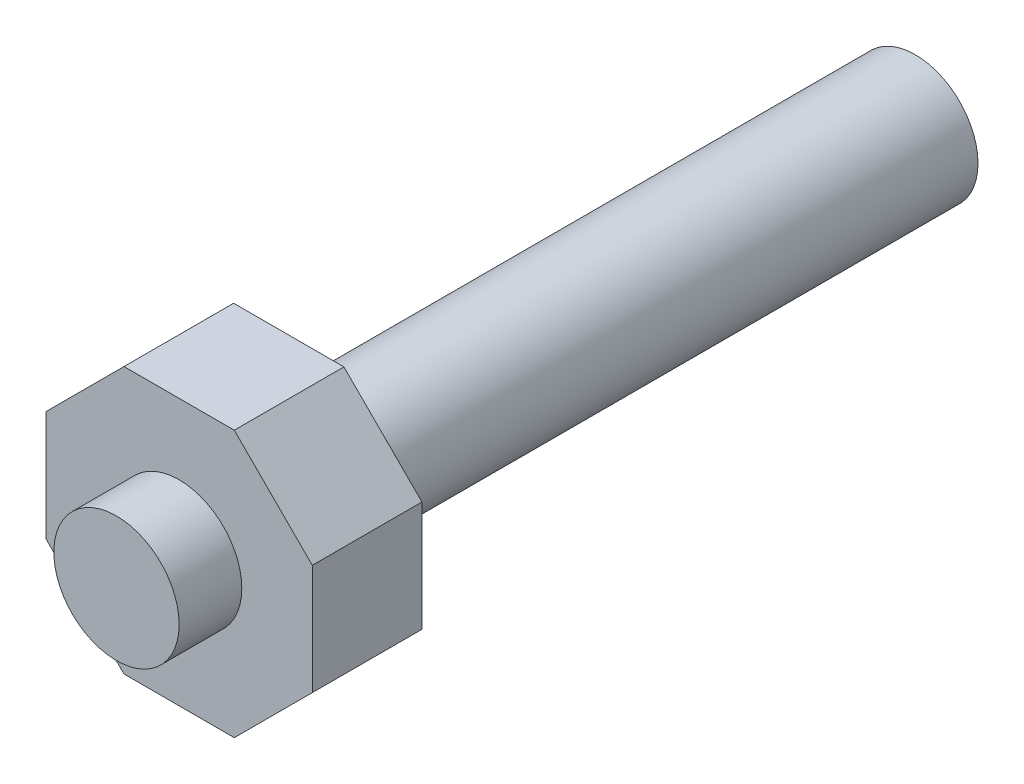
ISO-10303-21;
HEADER;
FILE_DESCRIPTION(('STEP AP214'),'2;1');
FILE_NAME('part.step','',(''),(''),'','','');
FILE_SCHEMA(('AUTOMOTIVE_DESIGN { 1 0 10303 214 1 1 1 1 }'));
ENDSEC;
DATA;
#1=APPLICATION_CONTEXT('core data for automotive mechanical design processes');
#2=APPLICATION_PROTOCOL_DEFINITION('international standard','automotive_design',2000,#1);
#3=PRODUCT_CONTEXT('',#1,'mechanical');
#4=PRODUCT('Part','Part','',(#3));
#5=PRODUCT_RELATED_PRODUCT_CATEGORY('part','',(#4));
#6=PRODUCT_DEFINITION_FORMATION('','',#4);
#7=PRODUCT_DEFINITION_CONTEXT('part definition',#1,'design');
#8=PRODUCT_DEFINITION('design','',#6,#7);
#9=PRODUCT_DEFINITION_SHAPE('','',#8);
#10=(LENGTH_UNIT() NAMED_UNIT(*) SI_UNIT(.MILLI.,.METRE.));
#11=(NAMED_UNIT(*) PLANE_ANGLE_UNIT() SI_UNIT($,.RADIAN.));
#12=(NAMED_UNIT(*) SI_UNIT($,.STERADIAN.) SOLID_ANGLE_UNIT());
#13=UNCERTAINTY_MEASURE_WITH_UNIT(LENGTH_MEASURE(1.E-05),#10,'distance_accuracy_value','');
#14=(GEOMETRIC_REPRESENTATION_CONTEXT(3) GLOBAL_UNCERTAINTY_ASSIGNED_CONTEXT((#13)) GLOBAL_UNIT_ASSIGNED_CONTEXT((#10,
#11,#12)) REPRESENTATION_CONTEXT('',''));
#15=CARTESIAN_POINT('',(0.,0.,0.));
#16=DIRECTION('',(0.,0.,1.));
#17=DIRECTION('',(1.,0.,0.));
#18=AXIS2_PLACEMENT_3D('',#15,#16,#17);
#19=CARTESIAN_POINT('',(4.,0.,40.));
#20=DIRECTION('',(0.,0.,1.));
#21=DIRECTION('',(1.,0.,0.));
#22=AXIS2_PLACEMENT_3D('',#19,#20,#21);
#23=PLANE('',#22);
#24=CARTESIAN_POINT('',(0.,0.,40.));
#25=DIRECTION('',(0.,0.,1.));
#26=DIRECTION('',(1.,0.,0.));
#27=AXIS2_PLACEMENT_3D('',#24,#25,#26);
#28=CIRCLE('',#27,4.);
#29=CARTESIAN_POINT('',(4.,0.,40.));
#30=VERTEX_POINT('',#29);
#31=EDGE_CURVE('E22',#30,#30,#28,.T.);
#32=ORIENTED_EDGE('',*,*,#31,.T.);
#33=EDGE_LOOP('',(#32));
#34=FACE_BOUND('',#33,.T.);
#35=DIRECTION('',(-0.707106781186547,-0.707106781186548,0.));
#36=VECTOR('',#35,1.);
#37=CARTESIAN_POINT('',(8.5,-3.52081528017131,40.));
#38=LINE('',#37,#36);
#39=CARTESIAN_POINT('',(8.5,-3.52081528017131,40.));
#40=VERTEX_POINT('',#39);
#41=CARTESIAN_POINT('',(3.52081528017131,-8.5,40.));
#42=VERTEX_POINT('',#41);
#43=EDGE_CURVE('E101',#40,#42,#38,.T.);
#44=ORIENTED_EDGE('',*,*,#43,.T.);
#45=DIRECTION('',(1.,0.,0.));
#46=VECTOR('',#45,1.);
#47=CARTESIAN_POINT('',(-3.5208152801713,-8.5,40.));
#48=LINE('',#47,#46);
#49=CARTESIAN_POINT('',(-3.5208152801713,-8.5,40.));
#50=VERTEX_POINT('',#49);
#51=EDGE_CURVE('E99',#50,#42,#48,.T.);
#52=ORIENTED_EDGE('',*,*,#51,.F.);
#53=DIRECTION('',(0.707106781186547,-0.707106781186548,0.));
#54=VECTOR('',#53,1.);
#55=CARTESIAN_POINT('',(-8.5,-3.5208152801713,40.));
#56=LINE('',#55,#54);
#57=CARTESIAN_POINT('',(-8.5,-3.5208152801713,40.));
#58=VERTEX_POINT('',#57);
#59=EDGE_CURVE('E29',#58,#50,#56,.T.);
#60=ORIENTED_EDGE('',*,*,#59,.F.);
#61=DIRECTION('',(0.,-1.,0.));
#62=VECTOR('',#61,1.);
#63=CARTESIAN_POINT('',(-8.5,3.52081528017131,40.));
#64=LINE('',#63,#62);
#65=CARTESIAN_POINT('',(-8.5,3.52081528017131,40.));
#66=VERTEX_POINT('',#65);
#67=EDGE_CURVE('E89',#66,#58,#64,.T.);
#68=ORIENTED_EDGE('',*,*,#67,.F.);
#69=DIRECTION('',(0.707106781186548,0.707106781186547,0.));
#70=VECTOR('',#69,1.);
#71=CARTESIAN_POINT('',(-8.5,3.52081528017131,40.));
#72=LINE('',#71,#70);
#73=CARTESIAN_POINT('',(-3.5208152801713,8.5,40.));
#74=VERTEX_POINT('',#73);
#75=EDGE_CURVE('E94',#66,#74,#72,.T.);
#76=ORIENTED_EDGE('',*,*,#75,.T.);
#77=DIRECTION('',(1.,0.,0.));
#78=VECTOR('',#77,1.);
#79=CARTESIAN_POINT('',(-3.5208152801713,8.5,40.));
#80=LINE('',#79,#78);
#81=CARTESIAN_POINT('',(3.5208152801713,8.5,40.));
#82=VERTEX_POINT('',#81);
#83=EDGE_CURVE('E216',#74,#82,#80,.T.);
#84=ORIENTED_EDGE('',*,*,#83,.T.);
#85=DIRECTION('',(0.707106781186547,-0.707106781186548,0.));
#86=VECTOR('',#85,1.);
#87=CARTESIAN_POINT('',(3.5208152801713,8.5,40.));
#88=LINE('',#87,#86);
#89=CARTESIAN_POINT('',(8.5,3.5208152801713,40.));
#90=VERTEX_POINT('',#89);
#91=EDGE_CURVE('E214',#82,#90,#88,.T.);
#92=ORIENTED_EDGE('',*,*,#91,.T.);
#93=DIRECTION('',(0.,-1.,0.));
#94=VECTOR('',#93,1.);
#95=CARTESIAN_POINT('',(8.5,3.5208152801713,40.));
#96=LINE('',#95,#94);
#97=EDGE_CURVE('E126',#90,#40,#96,.T.);
#98=ORIENTED_EDGE('',*,*,#97,.T.);
#99=EDGE_LOOP('',(#44,#52,#60,#68,#76,#84,#92,#98));
#100=FACE_BOUND('',#99,.T.);
#101=ADVANCED_FACE('F14',(#34,#100),#23,.F.);
#102=CARTESIAN_POINT('',(0.,0.,0.));
#103=DIRECTION('',(0.,0.,1.));
#104=DIRECTION('',(1.,0.,0.));
#105=AXIS2_PLACEMENT_3D('',#102,#103,#104);
#106=PLANE('',#105);
#107=CARTESIAN_POINT('',(0.,0.,0.));
#108=DIRECTION('',(0.,0.,1.));
#109=DIRECTION('',(1.,0.,0.));
#110=AXIS2_PLACEMENT_3D('',#107,#108,#109);
#111=CIRCLE('',#110,4.);
#112=CARTESIAN_POINT('',(4.,0.,0.));
#113=VERTEX_POINT('',#112);
#114=EDGE_CURVE('E9',#113,#113,#111,.T.);
#115=ORIENTED_EDGE('',*,*,#114,.F.);
#116=EDGE_LOOP('',(#115));
#117=FACE_BOUND('',#116,.T.);
#118=ADVANCED_FACE('F16',(#117),#106,.F.);
#119=CARTESIAN_POINT('',(0.,0.,80.));
#120=DIRECTION('',(0.,0.,1.));
#121=DIRECTION('',(1.,0.,0.));
#122=AXIS2_PLACEMENT_3D('',#119,#120,#121);
#123=CYLINDRICAL_SURFACE('',#122,4.);
#124=ORIENTED_EDGE('',*,*,#31,.F.);
#125=EDGE_LOOP('',(#124));
#126=FACE_BOUND('',#125,.T.);
#127=ORIENTED_EDGE('',*,*,#114,.T.);
#128=EDGE_LOOP('',(#127));
#129=FACE_BOUND('',#128,.T.);
#130=ADVANCED_FACE('F147',(#126,#129),#123,.T.);
#131=CARTESIAN_POINT('',(8.5,-3.52081528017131,47.));
#132=DIRECTION('',(0.707106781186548,-0.707106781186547,0.));
#133=DIRECTION('',(0.707106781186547,0.707106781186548,0.));
#134=AXIS2_PLACEMENT_3D('',#131,#132,#133);
#135=PLANE('',#134);
#136=DIRECTION('',(0.,0.,-1.));
#137=VECTOR('',#136,1.);
#138=CARTESIAN_POINT('',(8.5,-3.52081528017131,47.));
#139=LINE('',#138,#137);
#140=CARTESIAN_POINT('',(8.5,-3.52081528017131,47.));
#141=VERTEX_POINT('',#140);
#142=EDGE_CURVE('E136',#141,#40,#139,.T.);
#143=ORIENTED_EDGE('',*,*,#142,.F.);
#144=DIRECTION('',(-0.707106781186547,-0.707106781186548,0.));
#145=VECTOR('',#144,1.);
#146=CARTESIAN_POINT('',(8.5,-3.52081528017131,47.));
#147=LINE('',#146,#145);
#148=CARTESIAN_POINT('',(3.52081528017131,-8.5,47.));
#149=VERTEX_POINT('',#148);
#150=EDGE_CURVE('E37',#141,#149,#147,.T.);
#151=ORIENTED_EDGE('',*,*,#150,.T.);
#152=DIRECTION('',(0.,0.,-1.));
#153=VECTOR('',#152,1.);
#154=CARTESIAN_POINT('',(3.52081528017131,-8.5,47.));
#155=LINE('',#154,#153);
#156=EDGE_CURVE('E109',#149,#42,#155,.T.);
#157=ORIENTED_EDGE('',*,*,#156,.T.);
#158=ORIENTED_EDGE('',*,*,#43,.F.);
#159=EDGE_LOOP('',(#143,#151,#157,#158));
#160=FACE_BOUND('',#159,.T.);
#161=ADVANCED_FACE('F150',(#160),#135,.T.);
#162=CARTESIAN_POINT('',(8.5,3.5208152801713,47.));
#163=DIRECTION('',(1.,0.,0.));
#164=DIRECTION('',(0.,1.,0.));
#165=AXIS2_PLACEMENT_3D('',#162,#163,#164);
#166=PLANE('',#165);
#167=DIRECTION('',(0.,0.,-1.));
#168=VECTOR('',#167,1.);
#169=CARTESIAN_POINT('',(8.5,3.5208152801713,47.));
#170=LINE('',#169,#168);
#171=CARTESIAN_POINT('',(8.5,3.5208152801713,47.));
#172=VERTEX_POINT('',#171);
#173=EDGE_CURVE('E134',#172,#90,#170,.T.);
#174=ORIENTED_EDGE('',*,*,#173,.F.);
#175=DIRECTION('',(0.,-1.,0.));
#176=VECTOR('',#175,1.);
#177=CARTESIAN_POINT('',(8.5,3.5208152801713,47.));
#178=LINE('',#177,#176);
#179=EDGE_CURVE('E106',#172,#141,#178,.T.);
#180=ORIENTED_EDGE('',*,*,#179,.T.);
#181=ORIENTED_EDGE('',*,*,#142,.T.);
#182=ORIENTED_EDGE('',*,*,#97,.F.);
#183=EDGE_LOOP('',(#174,#180,#181,#182));
#184=FACE_BOUND('',#183,.T.);
#185=ADVANCED_FACE('F177',(#184),#166,.T.);
#186=CARTESIAN_POINT('',(3.5208152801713,8.5,47.));
#187=DIRECTION('',(0.707106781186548,0.707106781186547,0.));
#188=DIRECTION('',(-0.707106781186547,0.707106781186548,0.));
#189=AXIS2_PLACEMENT_3D('',#186,#187,#188);
#190=PLANE('',#189);
#191=DIRECTION('',(0.,0.,-1.));
#192=VECTOR('',#191,1.);
#193=CARTESIAN_POINT('',(3.5208152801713,8.5,47.));
#194=LINE('',#193,#192);
#195=CARTESIAN_POINT('',(3.5208152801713,8.5,47.));
#196=VERTEX_POINT('',#195);
#197=EDGE_CURVE('E132',#196,#82,#194,.T.);
#198=ORIENTED_EDGE('',*,*,#197,.F.);
#199=DIRECTION('',(0.707106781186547,-0.707106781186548,0.));
#200=VECTOR('',#199,1.);
#201=CARTESIAN_POINT('',(3.5208152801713,8.5,47.));
#202=LINE('',#201,#200);
#203=EDGE_CURVE('E110',#196,#172,#202,.T.);
#204=ORIENTED_EDGE('',*,*,#203,.T.);
#205=ORIENTED_EDGE('',*,*,#173,.T.);
#206=ORIENTED_EDGE('',*,*,#91,.F.);
#207=EDGE_LOOP('',(#198,#204,#205,#206));
#208=FACE_BOUND('',#207,.T.);
#209=ADVANCED_FACE('F180',(#208),#190,.T.);
#210=CARTESIAN_POINT('',(-3.5208152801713,8.5,47.));
#211=DIRECTION('',(0.,1.,0.));
#212=DIRECTION('',(0.,0.,1.));
#213=AXIS2_PLACEMENT_3D('',#210,#211,#212);
#214=PLANE('',#213);
#215=DIRECTION('',(0.,0.,-1.));
#216=VECTOR('',#215,1.);
#217=CARTESIAN_POINT('',(-3.5208152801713,8.5,47.));
#218=LINE('',#217,#216);
#219=CARTESIAN_POINT('',(-3.5208152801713,8.5,47.));
#220=VERTEX_POINT('',#219);
#221=EDGE_CURVE('E130',#220,#74,#218,.T.);
#222=ORIENTED_EDGE('',*,*,#221,.F.);
#223=DIRECTION('',(1.,0.,0.));
#224=VECTOR('',#223,1.);
#225=CARTESIAN_POINT('',(-3.5208152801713,8.5,47.));
#226=LINE('',#225,#224);
#227=EDGE_CURVE('E113',#220,#196,#226,.T.);
#228=ORIENTED_EDGE('',*,*,#227,.T.);
#229=ORIENTED_EDGE('',*,*,#197,.T.);
#230=ORIENTED_EDGE('',*,*,#83,.F.);
#231=EDGE_LOOP('',(#222,#228,#229,#230));
#232=FACE_BOUND('',#231,.T.);
#233=ADVANCED_FACE('F184',(#232),#214,.T.);
#234=CARTESIAN_POINT('',(-8.5,3.52081528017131,47.));
#235=DIRECTION('',(-0.707106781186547,0.707106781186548,0.));
#236=DIRECTION('',(-0.707106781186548,-0.707106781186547,0.));
#237=AXIS2_PLACEMENT_3D('',#234,#235,#236);
#238=PLANE('',#237);
#239=DIRECTION('',(0.,0.,-1.));
#240=VECTOR('',#239,1.);
#241=CARTESIAN_POINT('',(-8.5,3.52081528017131,47.));
#242=LINE('',#241,#240);
#243=CARTESIAN_POINT('',(-8.5,3.52081528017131,47.));
#244=VERTEX_POINT('',#243);
#245=EDGE_CURVE('E85',#244,#66,#242,.T.);
#246=ORIENTED_EDGE('',*,*,#245,.F.);
#247=DIRECTION('',(0.707106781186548,0.707106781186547,0.));
#248=VECTOR('',#247,1.);
#249=CARTESIAN_POINT('',(-8.5,3.52081528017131,47.));
#250=LINE('',#249,#248);
#251=EDGE_CURVE('E116',#244,#220,#250,.T.);
#252=ORIENTED_EDGE('',*,*,#251,.T.);
#253=ORIENTED_EDGE('',*,*,#221,.T.);
#254=ORIENTED_EDGE('',*,*,#75,.F.);
#255=EDGE_LOOP('',(#246,#252,#253,#254));
#256=FACE_BOUND('',#255,.T.);
#257=ADVANCED_FACE('F188',(#256),#238,.T.);
#258=CARTESIAN_POINT('',(-8.5,3.52081528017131,47.));
#259=DIRECTION('',(1.,0.,0.));
#260=DIRECTION('',(0.,1.,0.));
#261=AXIS2_PLACEMENT_3D('',#258,#259,#260);
#262=PLANE('',#261);
#263=DIRECTION('',(0.,0.,-1.));
#264=VECTOR('',#263,1.);
#265=CARTESIAN_POINT('',(-8.5,-3.5208152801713,47.));
#266=LINE('',#265,#264);
#267=CARTESIAN_POINT('',(-8.5,-3.5208152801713,47.));
#268=VERTEX_POINT('',#267);
#269=EDGE_CURVE('E77',#268,#58,#266,.T.);
#270=ORIENTED_EDGE('',*,*,#269,.F.);
#271=DIRECTION('',(0.,-1.,0.));
#272=VECTOR('',#271,1.);
#273=CARTESIAN_POINT('',(-8.5,3.52081528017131,47.));
#274=LINE('',#273,#272);
#275=EDGE_CURVE('E119',#244,#268,#274,.T.);
#276=ORIENTED_EDGE('',*,*,#275,.F.);
#277=ORIENTED_EDGE('',*,*,#245,.T.);
#278=ORIENTED_EDGE('',*,*,#67,.T.);
#279=EDGE_LOOP('',(#270,#276,#277,#278));
#280=FACE_BOUND('',#279,.T.);
#281=ADVANCED_FACE('F90',(#280),#262,.F.);
#282=CARTESIAN_POINT('',(-8.5,-3.5208152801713,47.));
#283=DIRECTION('',(0.707106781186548,0.707106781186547,0.));
#284=DIRECTION('',(-0.707106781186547,0.707106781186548,0.));
#285=AXIS2_PLACEMENT_3D('',#282,#283,#284);
#286=PLANE('',#285);
#287=DIRECTION('',(0.,0.,-1.));
#288=VECTOR('',#287,1.);
#289=CARTESIAN_POINT('',(-3.5208152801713,-8.5,47.));
#290=LINE('',#289,#288);
#291=CARTESIAN_POINT('',(-3.5208152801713,-8.5,47.));
#292=VERTEX_POINT('',#291);
#293=EDGE_CURVE('E86',#292,#50,#290,.T.);
#294=ORIENTED_EDGE('',*,*,#293,.F.);
#295=DIRECTION('',(0.707106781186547,-0.707106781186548,0.));
#296=VECTOR('',#295,1.);
#297=CARTESIAN_POINT('',(-8.5,-3.5208152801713,47.));
#298=LINE('',#297,#296);
#299=EDGE_CURVE('E81',#268,#292,#298,.T.);
#300=ORIENTED_EDGE('',*,*,#299,.F.);
#301=ORIENTED_EDGE('',*,*,#269,.T.);
#302=ORIENTED_EDGE('',*,*,#59,.T.);
#303=EDGE_LOOP('',(#294,#300,#301,#302));
#304=FACE_BOUND('',#303,.T.);
#305=ADVANCED_FACE('F79',(#304),#286,.F.);
#306=CARTESIAN_POINT('',(-3.5208152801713,-8.5,47.));
#307=DIRECTION('',(0.,1.,0.));
#308=DIRECTION('',(0.,0.,1.));
#309=AXIS2_PLACEMENT_3D('',#306,#307,#308);
#310=PLANE('',#309);
#311=DIRECTION('',(1.,0.,0.));
#312=VECTOR('',#311,1.);
#313=CARTESIAN_POINT('',(-3.5208152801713,-8.5,47.));
#314=LINE('',#313,#312);
#315=EDGE_CURVE('E122',#292,#149,#314,.T.);
#316=ORIENTED_EDGE('',*,*,#315,.F.);
#317=ORIENTED_EDGE('',*,*,#293,.T.);
#318=ORIENTED_EDGE('',*,*,#51,.T.);
#319=ORIENTED_EDGE('',*,*,#156,.F.);
#320=EDGE_LOOP('',(#316,#317,#318,#319));
#321=FACE_BOUND('',#320,.T.);
#322=ADVANCED_FACE('F175',(#321),#310,.F.);
#323=CARTESIAN_POINT('',(4.,0.,51.));
#324=DIRECTION('',(0.,0.,-1.));
#325=DIRECTION('',(-1.,0.,0.));
#326=AXIS2_PLACEMENT_3D('',#323,#324,#325);
#327=PLANE('',#326);
#328=CARTESIAN_POINT('',(0.,0.,51.));
#329=DIRECTION('',(0.,0.,1.));
#330=DIRECTION('',(1.,0.,0.));
#331=AXIS2_PLACEMENT_3D('',#328,#329,#330);
#332=CIRCLE('',#331,4.);
#333=CARTESIAN_POINT('',(4.,0.,51.));
#334=VERTEX_POINT('',#333);
#335=EDGE_CURVE('E138',#334,#334,#332,.T.);
#336=ORIENTED_EDGE('',*,*,#335,.T.);
#337=EDGE_LOOP('',(#336));
#338=FACE_BOUND('',#337,.T.);
#339=ADVANCED_FACE('F171',(#338),#327,.F.);
#340=CARTESIAN_POINT('',(0.,0.,80.));
#341=DIRECTION('',(0.,0.,1.));
#342=DIRECTION('',(1.,0.,0.));
#343=AXIS2_PLACEMENT_3D('',#340,#341,#342);
#344=CYLINDRICAL_SURFACE('',#343,4.);
#345=ORIENTED_EDGE('',*,*,#335,.F.);
#346=EDGE_LOOP('',(#345));
#347=FACE_BOUND('',#346,.T.);
#348=CARTESIAN_POINT('',(0.,0.,47.));
#349=DIRECTION('',(0.,0.,1.));
#350=DIRECTION('',(1.,0.,0.));
#351=AXIS2_PLACEMENT_3D('',#348,#349,#350);
#352=CIRCLE('',#351,4.);
#353=CARTESIAN_POINT('',(4.,0.,47.));
#354=VERTEX_POINT('',#353);
#355=EDGE_CURVE('E141',#354,#354,#352,.T.);
#356=ORIENTED_EDGE('',*,*,#355,.T.);
#357=EDGE_LOOP('',(#356));
#358=FACE_BOUND('',#357,.T.);
#359=ADVANCED_FACE('F167',(#347,#358),#344,.T.);
#360=CARTESIAN_POINT('',(10.,0.,47.));
#361=DIRECTION('',(0.,0.,-1.));
#362=DIRECTION('',(-1.,0.,0.));
#363=AXIS2_PLACEMENT_3D('',#360,#361,#362);
#364=PLANE('',#363);
#365=ORIENTED_EDGE('',*,*,#355,.F.);
#366=EDGE_LOOP('',(#365));
#367=FACE_BOUND('',#366,.T.);
#368=ORIENTED_EDGE('',*,*,#150,.F.);
#369=ORIENTED_EDGE('',*,*,#179,.F.);
#370=ORIENTED_EDGE('',*,*,#203,.F.);
#371=ORIENTED_EDGE('',*,*,#227,.F.);
#372=ORIENTED_EDGE('',*,*,#251,.F.);
#373=ORIENTED_EDGE('',*,*,#275,.T.);
#374=ORIENTED_EDGE('',*,*,#299,.T.);
#375=ORIENTED_EDGE('',*,*,#315,.T.);
#376=EDGE_LOOP('',(#368,#369,#370,#371,#372,#373,#374,#375));
#377=FACE_BOUND('',#376,.T.);
#378=ADVANCED_FACE('F164',(#367,#377),#364,.F.);
#379=CLOSED_SHELL('',(#101,#118,#130,#161,#185,#209,#233,#257,#281,#305,#322,#339,#359,#378));
#380=MANIFOLD_SOLID_BREP('B1',#379);
#381=ADVANCED_BREP_SHAPE_REPRESENTATION('',(#18,#380),#14);
#382=SHAPE_DEFINITION_REPRESENTATION(#9,#381);
ENDSEC;
END-ISO-10303-21;
